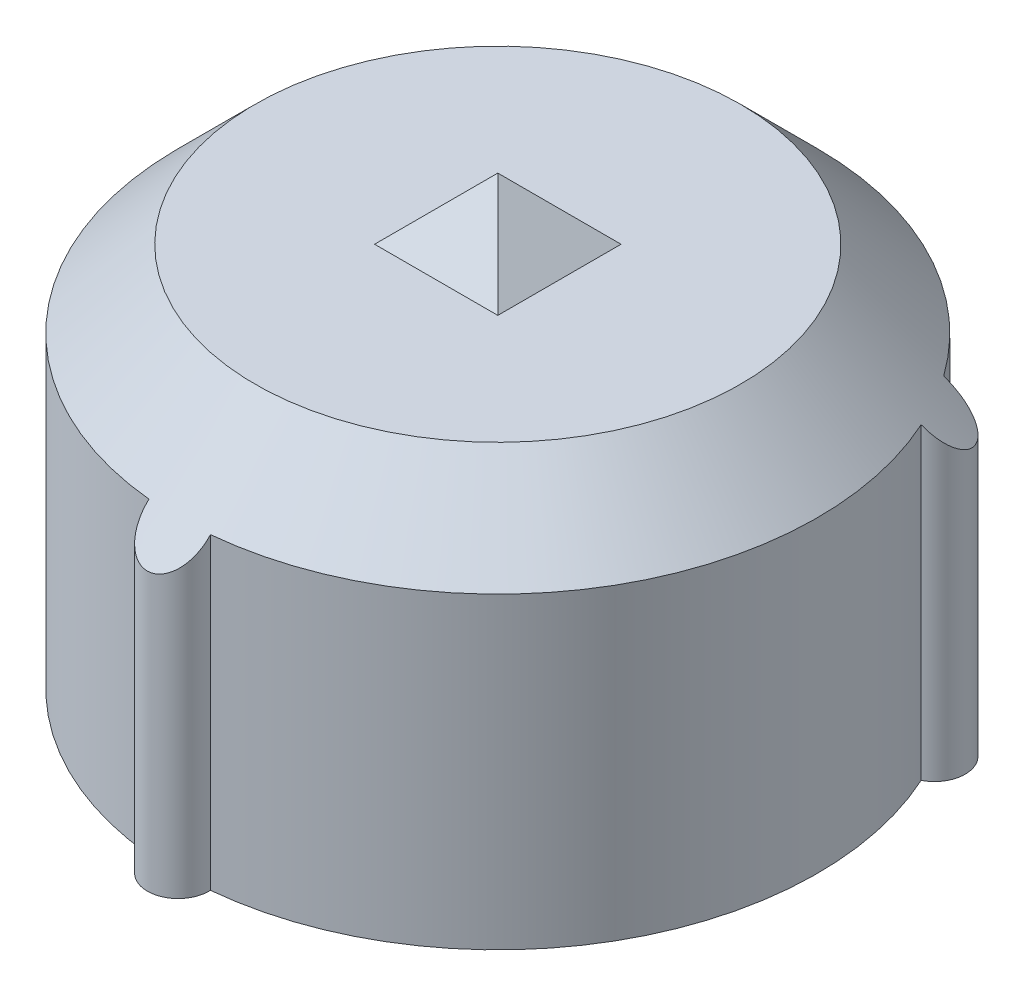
ISO-10303-21;
HEADER;
FILE_DESCRIPTION(('STEP AP214'),'2;1');
FILE_NAME('part.step','',(''),(''),'','','');
FILE_SCHEMA(('AUTOMOTIVE_DESIGN { 1 0 10303 214 1 1 1 1 }'));
ENDSEC;
DATA;
#1=APPLICATION_CONTEXT('core data for automotive mechanical design processes');
#2=APPLICATION_PROTOCOL_DEFINITION('international standard','automotive_design',2000,#1);
#3=PRODUCT_CONTEXT('',#1,'mechanical');
#4=PRODUCT('Part','Part','',(#3));
#5=PRODUCT_RELATED_PRODUCT_CATEGORY('part','',(#4));
#6=PRODUCT_DEFINITION_FORMATION('','',#4);
#7=PRODUCT_DEFINITION_CONTEXT('part definition',#1,'design');
#8=PRODUCT_DEFINITION('design','',#6,#7);
#9=PRODUCT_DEFINITION_SHAPE('','',#8);
#10=(LENGTH_UNIT() NAMED_UNIT(*) SI_UNIT(.MILLI.,.METRE.));
#11=(NAMED_UNIT(*) PLANE_ANGLE_UNIT() SI_UNIT($,.RADIAN.));
#12=(NAMED_UNIT(*) SI_UNIT($,.STERADIAN.) SOLID_ANGLE_UNIT());
#13=UNCERTAINTY_MEASURE_WITH_UNIT(LENGTH_MEASURE(1.E-05),#10,'distance_accuracy_value','');
#14=(GEOMETRIC_REPRESENTATION_CONTEXT(3) GLOBAL_UNCERTAINTY_ASSIGNED_CONTEXT((#13)) GLOBAL_UNIT_ASSIGNED_CONTEXT((#10,
#11,#12)) REPRESENTATION_CONTEXT('',''));
#15=CARTESIAN_POINT('',(0.,0.,0.));
#16=DIRECTION('',(0.,0.,1.));
#17=DIRECTION('',(1.,0.,0.));
#18=AXIS2_PLACEMENT_3D('',#15,#16,#17);
#19=CARTESIAN_POINT('',(4.55,5.,0.));
#20=DIRECTION('',(0.,-1.,0.));
#21=DIRECTION('',(0.,0.,-1.));
#22=AXIS2_PLACEMENT_3D('',#19,#20,#21);
#23=PLANE('',#22);
#24=DIRECTION('',(0.,0.,-1.));
#25=VECTOR('',#24,1.);
#26=CARTESIAN_POINT('',(0.8,5.,0.));
#27=LINE('',#26,#25);
#28=CARTESIAN_POINT('',(0.8,5.,0.799999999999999));
#29=VERTEX_POINT('',#28);
#30=CARTESIAN_POINT('',(0.8,5.,-0.800000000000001));
#31=VERTEX_POINT('',#30);
#32=EDGE_CURVE('E111',#29,#31,#27,.T.);
#33=ORIENTED_EDGE('',*,*,#32,.F.);
#34=DIRECTION('',(1.,0.,0.));
#35=VECTOR('',#34,1.);
#36=CARTESIAN_POINT('',(4.55,5.,0.799999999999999));
#37=LINE('',#36,#35);
#38=CARTESIAN_POINT('',(-0.799999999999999,5.,0.799999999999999));
#39=VERTEX_POINT('',#38);
#40=EDGE_CURVE('E107',#39,#29,#37,.T.);
#41=ORIENTED_EDGE('',*,*,#40,.F.);
#42=DIRECTION('',(0.,0.,1.));
#43=VECTOR('',#42,1.);
#44=CARTESIAN_POINT('',(-0.8,5.,0.));
#45=LINE('',#44,#43);
#46=CARTESIAN_POINT('',(-0.800000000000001,5.,-0.800000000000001));
#47=VERTEX_POINT('',#46);
#48=EDGE_CURVE('E110',#47,#39,#45,.T.);
#49=ORIENTED_EDGE('',*,*,#48,.F.);
#50=DIRECTION('',(-1.,0.,0.));
#51=VECTOR('',#50,1.);
#52=CARTESIAN_POINT('',(4.55,5.,-0.800000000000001));
#53=LINE('',#52,#51);
#54=EDGE_CURVE('E61',#31,#47,#53,.T.);
#55=ORIENTED_EDGE('',*,*,#54,.F.);
#56=EDGE_LOOP('',(#33,#41,#49,#55));
#57=FACE_BOUND('',#56,.T.);
#58=CARTESIAN_POINT('',(0.,5.,0.));
#59=DIRECTION('',(0.,-1.,0.));
#60=DIRECTION('',(0.,0.,-1.));
#61=AXIS2_PLACEMENT_3D('',#58,#59,#60);
#62=CIRCLE('',#61,3.15);
#63=CARTESIAN_POINT('',(0.,5.,-3.15));
#64=VERTEX_POINT('',#63);
#65=EDGE_CURVE('E249',#64,#64,#62,.T.);
#66=ORIENTED_EDGE('',*,*,#65,.F.);
#67=EDGE_LOOP('',(#66));
#68=FACE_BOUND('',#67,.T.);
#69=ADVANCED_FACE('F37',(#57,#68),#23,.F.);
#70=CARTESIAN_POINT('',(0.8,5.,0.));
#71=DIRECTION('',(0.707106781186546,0.707106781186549,0.));
#72=DIRECTION('',(-0.707106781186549,0.707106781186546,0.));
#73=AXIS2_PLACEMENT_3D('',#70,#71,#72);
#74=PLANE('',#73);
#75=DIRECTION('',(0.577350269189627,-0.577350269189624,0.577350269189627));
#76=VECTOR('',#75,1.);
#77=CARTESIAN_POINT('',(0.533333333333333,5.26666666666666,0.533333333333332));
#78=LINE('',#77,#76);
#79=CARTESIAN_POINT('',(0.,5.8,0.));
#80=VERTEX_POINT('',#79);
#81=EDGE_CURVE('E74',#80,#29,#78,.T.);
#82=ORIENTED_EDGE('',*,*,#81,.T.);
#83=ORIENTED_EDGE('',*,*,#32,.T.);
#84=DIRECTION('',(0.577350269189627,-0.577350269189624,-0.577350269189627));
#85=VECTOR('',#84,1.);
#86=CARTESIAN_POINT('',(2.05,3.75,-2.05));
#87=LINE('',#86,#85);
#88=EDGE_CURVE('E113',#80,#31,#87,.T.);
#89=ORIENTED_EDGE('',*,*,#88,.F.);
#90=EDGE_LOOP('',(#82,#83,#89));
#91=FACE_BOUND('',#90,.T.);
#92=ADVANCED_FACE('F140',(#91),#74,.T.);
#93=CARTESIAN_POINT('',(4.55,5.,-0.800000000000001));
#94=DIRECTION('',(0.,0.707106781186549,-0.707106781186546));
#95=DIRECTION('',(0.,0.707106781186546,0.707106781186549));
#96=AXIS2_PLACEMENT_3D('',#93,#94,#95);
#97=PLANE('',#96);
#98=ORIENTED_EDGE('',*,*,#88,.T.);
#99=ORIENTED_EDGE('',*,*,#54,.T.);
#100=DIRECTION('',(-0.577350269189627,-0.577350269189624,-0.577350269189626));
#101=VECTOR('',#100,1.);
#102=CARTESIAN_POINT('',(-0.533333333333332,5.26666666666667,-0.533333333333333));
#103=LINE('',#102,#101);
#104=EDGE_CURVE('E121',#80,#47,#103,.T.);
#105=ORIENTED_EDGE('',*,*,#104,.F.);
#106=EDGE_LOOP('',(#98,#99,#105));
#107=FACE_BOUND('',#106,.T.);
#108=ADVANCED_FACE('F138',(#107),#97,.T.);
#109=CARTESIAN_POINT('',(-0.8,5.,0.));
#110=DIRECTION('',(-0.707106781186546,0.707106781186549,0.));
#111=DIRECTION('',(-0.707106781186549,-0.707106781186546,0.));
#112=AXIS2_PLACEMENT_3D('',#109,#110,#111);
#113=PLANE('',#112);
#114=ORIENTED_EDGE('',*,*,#104,.T.);
#115=ORIENTED_EDGE('',*,*,#48,.T.);
#116=DIRECTION('',(-0.577350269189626,-0.577350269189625,0.577350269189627));
#117=VECTOR('',#116,1.);
#118=CARTESIAN_POINT('',(0.983333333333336,6.78333333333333,-0.983333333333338));
#119=LINE('',#118,#117);
#120=EDGE_CURVE('E119',#80,#39,#119,.T.);
#121=ORIENTED_EDGE('',*,*,#120,.F.);
#122=EDGE_LOOP('',(#114,#115,#121));
#123=FACE_BOUND('',#122,.T.);
#124=ADVANCED_FACE('F118',(#123),#113,.T.);
#125=CARTESIAN_POINT('',(4.55,5.,0.799999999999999));
#126=DIRECTION('',(0.,0.707106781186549,0.707106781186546));
#127=DIRECTION('',(0.,-0.707106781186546,0.707106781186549));
#128=AXIS2_PLACEMENT_3D('',#125,#126,#127);
#129=PLANE('',#128);
#130=ORIENTED_EDGE('',*,*,#120,.T.);
#131=ORIENTED_EDGE('',*,*,#40,.T.);
#132=ORIENTED_EDGE('',*,*,#81,.F.);
#133=EDGE_LOOP('',(#130,#131,#132));
#134=FACE_BOUND('',#133,.T.);
#135=ADVANCED_FACE('F39',(#134),#129,.T.);
#136=CARTESIAN_POINT('',(0.,1.,0.));
#137=DIRECTION('',(0.,-1.,0.));
#138=DIRECTION('',(0.,0.,-1.));
#139=AXIS2_PLACEMENT_3D('',#136,#137,#138);
#140=CONICAL_SURFACE('',#139,7.15000000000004,0.785398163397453);
#141=ORIENTED_EDGE('',*,*,#65,.T.);
#142=EDGE_LOOP('',(#141));
#143=FACE_BOUND('',#142,.T.);
#144=CARTESIAN_POINT('',(-0.399525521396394,4.00020000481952,4.13052289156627));
#145=CARTESIAN_POINT('',(-0.400256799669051,3.98508506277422,4.14563690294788));
#146=CARTESIAN_POINT('',(-0.400141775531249,3.97000027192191,4.16080392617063));
#147=CARTESIAN_POINT('',(-0.398167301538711,3.93994728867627,4.1911828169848));
#148=CARTESIAN_POINT('',(-0.396305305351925,3.92497929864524,4.20639471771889));
#149=CARTESIAN_POINT('',(-0.387975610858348,3.88015570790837,4.25219017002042));
#150=CARTESIAN_POINT('',(-0.378750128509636,3.85063355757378,4.28268027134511));
#151=CARTESIAN_POINT('',(-0.356224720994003,3.80200402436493,4.33339265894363));
#152=CARTESIAN_POINT('',(-0.344905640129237,3.78237596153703,4.35400984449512));
#153=CARTESIAN_POINT('',(-0.318010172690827,3.7447220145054,4.39381003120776));
#154=CARTESIAN_POINT('',(-0.302448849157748,3.72669075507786,4.41299780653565));
#155=CARTESIAN_POINT('',(-0.271063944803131,3.69698225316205,4.44478324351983));
#156=CARTESIAN_POINT('',(-0.256190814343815,3.68481603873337,4.45786028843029));
#157=CARTESIAN_POINT('',(-0.223779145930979,3.66228644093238,4.48216224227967));
#158=CARTESIAN_POINT('',(-0.206243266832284,3.65192128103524,4.49338897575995));
#159=CARTESIAN_POINT('',(-0.172248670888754,3.63531633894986,4.51142324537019));
#160=CARTESIAN_POINT('',(-0.156222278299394,3.62866679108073,4.51866524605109));
#161=CARTESIAN_POINT('',(-0.122759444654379,3.61725464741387,4.53111418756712));
#162=CARTESIAN_POINT('',(-0.105323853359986,3.6124909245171,4.53632234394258));
#163=CARTESIAN_POINT('',(-0.0693422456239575,3.60512985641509,4.54437719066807));
#164=CARTESIAN_POINT('',(-0.050789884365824,3.60254645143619,4.5472086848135));
#165=CARTESIAN_POINT('',(-0.0132949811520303,3.59979875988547,4.55022039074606));
#166=CARTESIAN_POINT('',(0.00564737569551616,3.59963335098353,4.55040183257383));
#167=CARTESIAN_POINT('',(0.0412428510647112,3.60161903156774,4.54822516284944));
#168=CARTESIAN_POINT('',(0.0579271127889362,3.60352819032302,4.54613227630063));
#169=CARTESIAN_POINT('',(0.0906003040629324,3.60916657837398,4.53995907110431));
#170=CARTESIAN_POINT('',(0.106589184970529,3.61289593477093,4.53587861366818));
#171=CARTESIAN_POINT('',(0.137922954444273,3.62208804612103,4.52583918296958));
#172=CARTESIAN_POINT('',(0.153240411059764,3.62759322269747,4.51983426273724));
#173=CARTESIAN_POINT('',(0.182543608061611,3.64004392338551,4.50628493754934));
#174=CARTESIAN_POINT('',(0.196528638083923,3.64699020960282,4.49873971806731));
#175=CARTESIAN_POINT('',(0.229168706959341,3.66555239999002,4.4786325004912));
#176=CARTESIAN_POINT('',(0.247004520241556,3.67784476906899,4.46536128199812));
#177=CARTESIAN_POINT('',(0.279520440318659,3.7042930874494,4.43694385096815));
#178=CARTESIAN_POINT('',(0.294194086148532,3.71845275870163,4.42179389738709));
#179=CARTESIAN_POINT('',(0.3250530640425,3.75326284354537,4.38474706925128));
#180=CARTESIAN_POINT('',(0.339996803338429,3.77446085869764,4.36233290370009));
#181=CARTESIAN_POINT('',(0.364772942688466,3.81842025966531,4.31621644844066));
#182=CARTESIAN_POINT('',(0.374593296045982,3.84118518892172,4.29251126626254));
#183=CARTESIAN_POINT('',(0.389130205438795,3.8865502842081,4.24566450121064));
#184=CARTESIAN_POINT('',(0.394063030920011,3.90910880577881,4.2225480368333));
#185=CARTESIAN_POINT('',(0.399793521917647,3.95450369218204,4.17640583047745));
#186=CARTESIAN_POINT('',(0.400621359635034,3.9773367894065,4.15338067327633));
#187=CARTESIAN_POINT('',(0.399525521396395,4.00020000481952,4.13052289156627));
#188=B_SPLINE_CURVE_WITH_KNOTS('',3,(#144,#145,#146,#147,#148,#149,#150,#151,#152,#153,#154,
#155,#156,#157,#158,#159,#160,#161,#162,#163,#164,#165,#166,#167,#168,#169,#170,#171,#172,#173,
#174,#175,#176,#177,#178,#179,#180,#181,#182,#183,#184,#185,#186,#187),.UNSPECIFIED.,.F.,.F.,(4,
2,2,2,2,2,2,2,2,2,2,2,2,2,2,2,2,2,2,2,2,4),(0.,0.0641179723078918,0.12832954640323,
0.257815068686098,0.349429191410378,0.440722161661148,0.510209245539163,0.579627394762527,
0.635807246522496,0.691953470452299,0.748456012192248,0.804932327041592,0.855465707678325,
0.906002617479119,0.957849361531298,1.00972359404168,1.08551176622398,1.16145335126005,
1.26374061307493,1.36626731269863,1.46402219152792,1.56105748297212),.UNSPECIFIED.);
#189=CARTESIAN_POINT('',(-0.399535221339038,4.00000000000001,4.13072289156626));
#190=VERTEX_POINT('',#189);
#191=CARTESIAN_POINT('',(0.399535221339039,4.00000000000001,4.13072289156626));
#192=VERTEX_POINT('',#191);
#193=EDGE_CURVE('E131',#190,#192,#188,.T.);
#194=ORIENTED_EDGE('',*,*,#193,.T.);
#195=CARTESIAN_POINT('',(0.,4.00000000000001,0.));
#196=DIRECTION('',(0.,-1.,0.));
#197=DIRECTION('',(0.,0.,-1.));
#198=AXIS2_PLACEMENT_3D('',#195,#196,#197);
#199=CIRCLE('',#198,4.15);
#200=CARTESIAN_POINT('',(3.77707857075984,4.00000000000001,-1.71935379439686));
#201=VERTEX_POINT('',#200);
#202=EDGE_CURVE('E213',#192,#201,#199,.F.);
#203=ORIENTED_EDGE('',*,*,#202,.T.);
#204=CARTESIAN_POINT('',(3.31649011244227,4.38274373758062,-1.7869283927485));
#205=CARTESIAN_POINT('',(3.33206933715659,4.37614462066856,-1.77192294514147));
#206=CARTESIAN_POINT('',(3.34838268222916,4.36791848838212,-1.75863519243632));
#207=CARTESIAN_POINT('',(3.38167759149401,4.34907165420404,-1.73540647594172));
#208=CARTESIAN_POINT('',(3.39864953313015,4.33847903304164,-1.72542942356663));
#209=CARTESIAN_POINT('',(3.43303008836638,4.31544889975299,-1.7083107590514));
#210=CARTESIAN_POINT('',(3.45044145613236,4.30299226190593,-1.70120175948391));
#211=CARTESIAN_POINT('',(3.48526311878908,4.27679303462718,-1.68962662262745));
#212=CARTESIAN_POINT('',(3.50267314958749,4.26304566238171,-1.68517080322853));
#213=CARTESIAN_POINT('',(3.54584300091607,4.22760207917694,-1.67703556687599));
#214=CARTESIAN_POINT('',(3.57143702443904,4.20536073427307,-1.67485147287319));
#215=CARTESIAN_POINT('',(3.62154733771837,4.15980293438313,-1.6751639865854));
#216=CARTESIAN_POINT('',(3.64606393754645,4.13648679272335,-1.67765923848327));
#217=CARTESIAN_POINT('',(3.68863471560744,4.09435934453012,-1.68588678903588));
#218=CARTESIAN_POINT('',(3.70695087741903,4.07564935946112,-1.6908140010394));
#219=CARTESIAN_POINT('',(3.74259832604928,4.03809738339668,-1.70314519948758));
#220=CARTESIAN_POINT('',(3.75992915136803,4.01925533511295,-1.71055033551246));
#221=CARTESIAN_POINT('',(3.80374596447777,3.97005822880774,-1.73304245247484));
#222=CARTESIAN_POINT('',(3.82931579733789,3.93974117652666,-1.75005393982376));
#223=CARTESIAN_POINT('',(3.87656266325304,3.88005670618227,-1.79018123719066));
#224=CARTESIAN_POINT('',(3.89823923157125,3.85068940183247,-1.81329777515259));
#225=CARTESIAN_POINT('',(3.93081435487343,3.80220050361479,-1.85800384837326));
#226=CARTESIAN_POINT('',(3.94301646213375,3.78257392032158,-1.87809828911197));
#227=CARTESIAN_POINT('',(3.9640710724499,3.74489035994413,-1.92128977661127));
#228=CARTESIAN_POINT('',(3.97292956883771,3.72683061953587,-1.94438135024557));
#229=CARTESIAN_POINT('',(3.98479151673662,3.69708568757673,-1.98748311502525));
#230=CARTESIAN_POINT('',(3.98868913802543,3.68490971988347,-2.00690669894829));
#231=CARTESIAN_POINT('',(3.99354562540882,3.66236389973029,-2.04713299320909));
#232=CARTESIAN_POINT('',(3.99450813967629,3.65199182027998,-2.067933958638));
#233=CARTESIAN_POINT('',(3.99314295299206,3.63537375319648,-2.10639507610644));
#234=CARTESIAN_POINT('',(3.99140767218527,3.62871811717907,-2.12389775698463));
#235=CARTESIAN_POINT('',(3.98546905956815,3.61729360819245,-2.15910834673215));
#236=CARTESIAN_POINT('',(3.9812671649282,3.61252363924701,-2.17681613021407));
#237=CARTESIAN_POINT('',(3.97026201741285,3.60515038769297,-2.21201386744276));
#238=CARTESIAN_POINT('',(3.96344243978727,3.60256103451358,-2.22950172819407));
#239=CARTESIAN_POINT('',(3.94731044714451,3.59980223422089,-2.26349091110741));
#240=CARTESIAN_POINT('',(3.93799916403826,3.59963169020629,-2.27999267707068));
#241=CARTESIAN_POINT('',(3.91832132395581,3.60160870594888,-2.30974134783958));
#242=CARTESIAN_POINT('',(3.90816933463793,3.60351390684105,-2.32314800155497));
#243=CARTESIAN_POINT('',(3.88649097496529,3.60914497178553,-2.34836559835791));
#244=CARTESIAN_POINT('',(3.87496452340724,3.61287094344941,-2.36017644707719));
#245=CARTESIAN_POINT('',(3.8506079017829,3.62205613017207,-2.38229949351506));
#246=CARTESIAN_POINT('',(3.83775180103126,3.62755751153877,-2.39256526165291));
#247=CARTESIAN_POINT('',(3.81137174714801,3.64000082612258,-2.41117404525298));
#248=CARTESIAN_POINT('',(3.79784745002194,3.64694350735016,-2.419516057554));
#249=CARTESIAN_POINT('',(3.76412436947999,3.66549460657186,-2.43773528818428));
#250=CARTESIAN_POINT('',(3.74372087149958,3.6777790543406,-2.44654948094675));
#251=CARTESIAN_POINT('',(3.70286324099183,3.70421371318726,-2.46051054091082));
#252=CARTESIAN_POINT('',(3.68240909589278,3.71836797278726,-2.46564929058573));
#253=CARTESIAN_POINT('',(3.6348868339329,3.7531770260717,-2.47386722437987));
#254=CARTESIAN_POINT('',(3.60799159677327,3.77438098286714,-2.47560923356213));
#255=CARTESIAN_POINT('',(3.55567564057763,3.81832547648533,-2.47402030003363));
#256=CARTESIAN_POINT('',(3.53025648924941,3.84106759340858,-2.47068406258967));
#257=CARTESIAN_POINT('',(3.48247444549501,3.88636889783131,-2.45987881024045));
#258=CARTESIAN_POINT('',(3.46002381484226,3.9088857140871,-2.45261306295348));
#259=CARTESIAN_POINT('',(3.41712390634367,3.95433625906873,-2.43451929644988));
#260=CARTESIAN_POINT('',(3.39667234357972,3.97726947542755,-2.42369540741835));
#261=CARTESIAN_POINT('',(3.3677335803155,4.01165664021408,-2.4050480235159));
#262=CARTESIAN_POINT('',(3.35840128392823,4.02308430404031,-2.3984525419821));
#263=CARTESIAN_POINT('',(3.34033125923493,4.04590815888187,-2.38448247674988));
#264=CARTESIAN_POINT('',(3.33159288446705,4.05730437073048,-2.37710876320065));
#265=CARTESIAN_POINT('',(3.3231609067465,4.06867319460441,-2.36935224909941));
#266=B_SPLINE_CURVE_WITH_KNOTS('',3,(#204,#205,#206,#207,#208,#209,#210,#211,#212,#213,#214,
#215,#216,#217,#218,#219,#220,#221,#222,#223,#224,#225,#226,#227,#228,#229,#230,#231,#232,#233,
#234,#235,#236,#237,#238,#239,#240,#241,#242,#243,#244,#245,#246,#247,#248,#249,#250,#251,#252,
#253,#254,#255,#256,#257,#258,#259,#260,#261,#262,#263,#264,#265),.UNSPECIFIED.,.F.,.F.,(4,2,2,
2,2,2,2,2,2,2,2,2,2,2,2,2,2,2,2,2,2,2,2,2,2,2,2,2,2,2,4),(0.,0.0674817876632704,
0.134201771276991,0.201660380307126,0.269379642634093,0.370869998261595,0.472330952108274,
0.552124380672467,0.631954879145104,0.760826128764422,0.889712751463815,0.981289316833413,
1.07270094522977,1.1422188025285,1.21165021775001,1.26784155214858,1.32400017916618,
1.38051487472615,1.43700394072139,1.48754090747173,1.53808086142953,1.5899224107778,
1.64179093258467,1.71755316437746,1.79348221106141,1.89580927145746,1.99824309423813,
2.09582435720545,2.19329274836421,2.24175097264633,2.29015557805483),.UNSPECIFIED.);
#267=CARTESIAN_POINT('',(3.3775433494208,4.00000000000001,-2.41136909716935));
#268=VERTEX_POINT('',#267);
#269=EDGE_CURVE('E52',#201,#268,#266,.T.);
#270=ORIENTED_EDGE('',*,*,#269,.T.);
#271=CARTESIAN_POINT('',(0.,4.00000000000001,0.));
#272=DIRECTION('',(0.,-1.,0.));
#273=DIRECTION('',(0.,0.,-1.));
#274=AXIS2_PLACEMENT_3D('',#271,#272,#273);
#275=CIRCLE('',#274,4.15);
#276=CARTESIAN_POINT('',(-3.37754334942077,4.00000000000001,-2.41136909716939));
#277=VERTEX_POINT('',#276);
#278=EDGE_CURVE('E11',#268,#277,#275,.F.);
#279=ORIENTED_EDGE('',*,*,#278,.T.);
#280=CARTESIAN_POINT('',(-3.32316090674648,4.06867319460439,-2.36935224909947));
#281=CARTESIAN_POINT('',(-3.33474926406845,4.05305120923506,-2.38000692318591));
#282=CARTESIAN_POINT('',(-3.34690916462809,4.03738283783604,-2.38994094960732));
#283=CARTESIAN_POINT('',(-3.37231555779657,4.00602772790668,-2.40831792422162));
#284=CARTESIAN_POINT('',(-3.3855629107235,3.99034098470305,-2.41675967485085));
#285=CARTESIAN_POINT('',(-3.42701130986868,3.94318732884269,-2.43985328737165));
#286=CARTESIAN_POINT('',(-3.4567573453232,3.91184457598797,-2.45212501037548));
#287=CARTESIAN_POINT('',(-3.51262168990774,3.85735862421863,-2.4674540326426));
#288=CARTESIAN_POINT('',(-3.538084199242,3.83393693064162,-2.47195022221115));
#289=CARTESIAN_POINT('',(-3.59060683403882,3.78856700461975,-2.47584747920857));
#290=CARTESIAN_POINT('',(-3.61766176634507,3.76661443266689,-2.47526428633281));
#291=CARTESIAN_POINT('',(-3.66545806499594,3.73051626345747,-2.46909598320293));
#292=CARTESIAN_POINT('',(-3.68597574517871,3.71584193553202,-2.46487524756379));
#293=CARTESIAN_POINT('',(-3.7271256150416,3.68822308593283,-2.45280584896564));
#294=CARTESIAN_POINT('',(-3.74775763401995,3.67527647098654,-2.44496162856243));
#295=CARTESIAN_POINT('',(-3.78416294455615,3.6542535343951,-2.42736034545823));
#296=CARTESIAN_POINT('',(-3.80003976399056,3.64572646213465,-2.41836032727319));
#297=CARTESIAN_POINT('',(-3.83100133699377,3.63053481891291,-2.39776593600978));
#298=CARTESIAN_POINT('',(-3.84608645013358,3.62386939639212,-2.38617275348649));
#299=CARTESIAN_POINT('',(-3.87501393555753,3.61276037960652,-2.36033002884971));
#300=CARTESIAN_POINT('',(-3.8888441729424,3.60833690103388,-2.34605795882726));
#301=CARTESIAN_POINT('',(-3.91443504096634,3.60216143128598,-2.31525881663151));
#302=CARTESIAN_POINT('',(-3.92619777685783,3.60040670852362,-2.29873406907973));
#303=CARTESIAN_POINT('',(-3.945594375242,3.59976821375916,-2.26653840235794));
#304=CARTESIAN_POINT('',(-3.95357814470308,3.60050973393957,-2.25108337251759));
#305=CARTESIAN_POINT('',(-3.96740520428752,3.60400892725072,-2.21946509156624));
#306=CARTESIAN_POINT('',(-3.97324865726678,3.60676644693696,-2.20330189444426));
#307=CARTESIAN_POINT('',(-3.98262084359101,3.61402799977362,-2.17118254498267));
#308=CARTESIAN_POINT('',(-3.98620515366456,3.61848537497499,-2.15523173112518));
#309=CARTESIAN_POINT('',(-3.99137846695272,3.62891915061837,-2.12351158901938));
#310=CARTESIAN_POINT('',(-3.99296664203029,3.6348961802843,-2.10774233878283));
#311=CARTESIAN_POINT('',(-3.99456852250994,3.65075218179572,-2.07051670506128));
#312=CARTESIAN_POINT('',(-3.99370988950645,3.66123908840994,-2.0492806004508));
#313=CARTESIAN_POINT('',(-3.98893489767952,3.6841031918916,-2.00821580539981));
#314=CARTESIAN_POINT('',(-3.9850125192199,3.69648407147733,-1.98838996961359));
#315=CARTESIAN_POINT('',(-3.97284216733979,3.72711185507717,-1.94392793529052));
#316=CARTESIAN_POINT('',(-3.96357498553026,3.745918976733,-1.91995824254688));
#317=CARTESIAN_POINT('',(-3.94146796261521,3.78519054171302,-1.87526721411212));
#318=CARTESIAN_POINT('',(-3.92862300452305,3.80565732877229,-1.85455059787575));
#319=CARTESIAN_POINT('',(-3.89575759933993,3.85407696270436,-1.81059234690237));
#320=CARTESIAN_POINT('',(-3.87474368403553,3.88240797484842,-1.78851009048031));
#321=CARTESIAN_POINT('',(-3.8290938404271,3.93996563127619,-1.74999759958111));
#322=CARTESIAN_POINT('',(-3.80445449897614,3.96919309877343,-1.73357274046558));
#323=CARTESIAN_POINT('',(-3.75202989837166,4.02819048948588,-1.70633755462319));
#324=CARTESIAN_POINT('',(-3.7242083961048,4.05796256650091,-1.69560181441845));
#325=CARTESIAN_POINT('',(-3.66629416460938,4.11693754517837,-1.68044915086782));
#326=CARTESIAN_POINT('',(-3.63620204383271,4.14614059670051,-1.67603054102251));
#327=CARTESIAN_POINT('',(-3.58193800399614,4.19599559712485,-1.67450097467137));
#328=CARTESIAN_POINT('',(-3.55812186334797,4.21698968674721,-1.67586490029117));
#329=CARTESIAN_POINT('',(-3.50992088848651,4.25738440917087,-1.68318145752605));
#330=CARTESIAN_POINT('',(-3.48553847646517,4.27679063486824,-1.68911714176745));
#331=CARTESIAN_POINT('',(-3.44448741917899,4.30727806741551,-1.70357699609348));
#332=CARTESIAN_POINT('',(-3.42783162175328,4.31904410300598,-1.71067764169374));
#333=CARTESIAN_POINT('',(-3.39989862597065,4.33753492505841,-1.72501805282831));
#334=CARTESIAN_POINT('',(-3.38854556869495,4.34469592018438,-1.73154071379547));
#335=CARTESIAN_POINT('',(-3.35635116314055,4.3638224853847,-1.75228755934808));
#336=CARTESIAN_POINT('',(-3.33588866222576,4.37451767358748,-1.76826062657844));
#337=CARTESIAN_POINT('',(-3.31649011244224,4.38274373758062,-1.78692839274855));
#338=B_SPLINE_CURVE_WITH_KNOTS('',3,(#280,#281,#282,#283,#284,#285,#286,#287,#288,#289,#290,
#291,#292,#293,#294,#295,#296,#297,#298,#299,#300,#301,#302,#303,#304,#305,#306,#307,#308,#309,
#310,#311,#312,#313,#314,#315,#316,#317,#318,#319,#320,#321,#322,#323,#324,#325,#326,#327,#328,
#329,#330,#331,#332,#333,#334,#335,#336,#337),.UNSPECIFIED.,.F.,.F.,(4,2,2,2,2,2,2,2,2,2,2,2,2,
2,2,2,2,2,2,2,2,2,2,2,2,2,2,2,4),(0.,0.0664845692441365,0.133022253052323,0.267013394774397,
0.371326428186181,0.475316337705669,0.55178981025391,0.628169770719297,0.688372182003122,
0.748547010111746,0.809252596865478,0.869896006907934,0.92186627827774,0.973832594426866,
1.02446471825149,1.07511784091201,1.14582597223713,1.21667338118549,1.31169171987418,
1.40684665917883,1.53104591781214,1.65536286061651,1.78127166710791,1.90714685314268,
2.00218335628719,2.09686924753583,2.16144285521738,2.20611835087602,2.28983714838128),.UNSPECIFIED.);
#339=CARTESIAN_POINT('',(-3.77707857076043,4.00000000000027,-1.71935379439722));
#340=VERTEX_POINT('',#339);
#341=EDGE_CURVE('E219',#277,#340,#338,.T.);
#342=ORIENTED_EDGE('',*,*,#341,.T.);
#343=CARTESIAN_POINT('',(0.,4.00000000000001,0.));
#344=DIRECTION('',(0.,-1.,0.));
#345=DIRECTION('',(0.,0.,-1.));
#346=AXIS2_PLACEMENT_3D('',#343,#344,#345);
#347=CIRCLE('',#346,4.15);
#348=EDGE_CURVE('E84',#340,#190,#347,.F.);
#349=ORIENTED_EDGE('',*,*,#348,.T.);
#350=EDGE_LOOP('',(#194,#203,#270,#279,#342,#349));
#351=FACE_BOUND('',#350,.T.);
#352=ADVANCED_FACE('F236',(#143,#351),#140,.T.);
#353=CARTESIAN_POINT('',(0.,0.,0.));
#354=DIRECTION('',(0.,1.,0.));
#355=DIRECTION('',(0.,0.,1.));
#356=AXIS2_PLACEMENT_3D('',#353,#354,#355);
#357=PLANE('',#356);
#358=CARTESIAN_POINT('',(0.,0.,0.));
#359=DIRECTION('',(0.,1.,0.));
#360=DIRECTION('',(0.,0.,1.));
#361=AXIS2_PLACEMENT_3D('',#358,#359,#360);
#362=CIRCLE('',#361,4.15);
#363=CARTESIAN_POINT('',(0.399535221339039,0.,4.13072289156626));
#364=VERTEX_POINT('',#363);
#365=CARTESIAN_POINT('',(3.77707857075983,0.,-1.71935379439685));
#366=VERTEX_POINT('',#365);
#367=EDGE_CURVE('E156',#364,#366,#362,.T.);
#368=ORIENTED_EDGE('',*,*,#367,.F.);
#369=CARTESIAN_POINT('',(0.,0.,4.15));
#370=DIRECTION('',(0.,1.,0.));
#371=DIRECTION('',(0.,0.,1.));
#372=AXIS2_PLACEMENT_3D('',#369,#370,#371);
#373=CIRCLE('',#372,0.4);
#374=CARTESIAN_POINT('',(-0.399535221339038,0.,4.13072289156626));
#375=VERTEX_POINT('',#374);
#376=EDGE_CURVE('E148',#375,#364,#373,.T.);
#377=ORIENTED_EDGE('',*,*,#376,.F.);
#378=CARTESIAN_POINT('',(0.,0.,0.));
#379=DIRECTION('',(0.,1.,0.));
#380=DIRECTION('',(0.,0.,1.));
#381=AXIS2_PLACEMENT_3D('',#378,#379,#380);
#382=CIRCLE('',#381,4.15);
#383=CARTESIAN_POINT('',(-3.77707857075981,0.,-1.7193537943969));
#384=VERTEX_POINT('',#383);
#385=EDGE_CURVE('E142',#384,#375,#382,.T.);
#386=ORIENTED_EDGE('',*,*,#385,.F.);
#387=CARTESIAN_POINT('',(-3.59400542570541,0.,-2.07500000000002));
#388=DIRECTION('',(0.,1.,0.));
#389=DIRECTION('',(0.,0.,1.));
#390=AXIS2_PLACEMENT_3D('',#387,#388,#389);
#391=CIRCLE('',#390,0.4);
#392=CARTESIAN_POINT('',(-3.37754334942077,0.,-2.41136909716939));
#393=VERTEX_POINT('',#392);
#394=EDGE_CURVE('E167',#393,#384,#391,.T.);
#395=ORIENTED_EDGE('',*,*,#394,.F.);
#396=CARTESIAN_POINT('',(0.,0.,0.));
#397=DIRECTION('',(0.,1.,0.));
#398=DIRECTION('',(0.,0.,1.));
#399=AXIS2_PLACEMENT_3D('',#396,#397,#398);
#400=CIRCLE('',#399,4.15);
#401=CARTESIAN_POINT('',(3.3775433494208,0.,-2.41136909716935));
#402=VERTEX_POINT('',#401);
#403=EDGE_CURVE('E164',#402,#393,#400,.T.);
#404=ORIENTED_EDGE('',*,*,#403,.F.);
#405=CARTESIAN_POINT('',(3.59400542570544,0.,-2.07499999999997));
#406=DIRECTION('',(0.,1.,0.));
#407=DIRECTION('',(0.,0.,1.));
#408=AXIS2_PLACEMENT_3D('',#405,#406,#407);
#409=CIRCLE('',#408,0.4);
#410=EDGE_CURVE('E160',#366,#402,#409,.T.);
#411=ORIENTED_EDGE('',*,*,#410,.F.);
#412=EDGE_LOOP('',(#368,#377,#386,#395,#404,#411));
#413=FACE_BOUND('',#412,.T.);
#414=ADVANCED_FACE('F192',(#413),#357,.F.);
#415=CARTESIAN_POINT('',(0.,5.,0.));
#416=DIRECTION('',(0.,-1.,0.));
#417=DIRECTION('',(0.,0.,-1.));
#418=AXIS2_PLACEMENT_3D('',#415,#416,#417);
#419=CYLINDRICAL_SURFACE('',#418,4.15);
#420=ORIENTED_EDGE('',*,*,#348,.F.);
#421=DIRECTION('',(0.,-1.,0.));
#422=VECTOR('',#421,1.);
#423=CARTESIAN_POINT('',(-3.77707857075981,5.,-1.7193537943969));
#424=LINE('',#423,#422);
#425=EDGE_CURVE('E171',#340,#384,#424,.T.);
#426=ORIENTED_EDGE('',*,*,#425,.T.);
#427=ORIENTED_EDGE('',*,*,#385,.T.);
#428=DIRECTION('',(0.,-1.,0.));
#429=VECTOR('',#428,1.);
#430=CARTESIAN_POINT('',(-0.399535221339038,5.,4.13072289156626));
#431=LINE('',#430,#429);
#432=EDGE_CURVE('E46',#190,#375,#431,.T.);
#433=ORIENTED_EDGE('',*,*,#432,.F.);
#434=EDGE_LOOP('',(#420,#426,#427,#433));
#435=FACE_BOUND('',#434,.T.);
#436=ADVANCED_FACE('F195',(#435),#419,.T.);
#437=CARTESIAN_POINT('',(0.,5.,0.));
#438=DIRECTION('',(0.,-1.,0.));
#439=DIRECTION('',(0.,0.,-1.));
#440=AXIS2_PLACEMENT_3D('',#437,#438,#439);
#441=CYLINDRICAL_SURFACE('',#440,4.15);
#442=ORIENTED_EDGE('',*,*,#278,.F.);
#443=DIRECTION('',(0.,-1.,0.));
#444=VECTOR('',#443,1.);
#445=CARTESIAN_POINT('',(3.3775433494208,5.,-2.41136909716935));
#446=LINE('',#445,#444);
#447=EDGE_CURVE('E176',#268,#402,#446,.T.);
#448=ORIENTED_EDGE('',*,*,#447,.T.);
#449=ORIENTED_EDGE('',*,*,#403,.T.);
#450=DIRECTION('',(0.,-1.,0.));
#451=VECTOR('',#450,1.);
#452=CARTESIAN_POINT('',(-3.37754334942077,5.,-2.41136909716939));
#453=LINE('',#452,#451);
#454=EDGE_CURVE('E174',#277,#393,#453,.T.);
#455=ORIENTED_EDGE('',*,*,#454,.F.);
#456=EDGE_LOOP('',(#442,#448,#449,#455));
#457=FACE_BOUND('',#456,.T.);
#458=ADVANCED_FACE('F204',(#457),#441,.T.);
#459=CARTESIAN_POINT('',(-3.59400542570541,5.,-2.07500000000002));
#460=DIRECTION('',(0.,-1.,0.));
#461=DIRECTION('',(0.,0.,-1.));
#462=AXIS2_PLACEMENT_3D('',#459,#460,#461);
#463=CYLINDRICAL_SURFACE('',#462,0.4);
#464=ORIENTED_EDGE('',*,*,#341,.F.);
#465=ORIENTED_EDGE('',*,*,#454,.T.);
#466=ORIENTED_EDGE('',*,*,#394,.T.);
#467=ORIENTED_EDGE('',*,*,#425,.F.);
#468=EDGE_LOOP('',(#464,#465,#466,#467));
#469=FACE_BOUND('',#468,.T.);
#470=ADVANCED_FACE('F200',(#469),#463,.T.);
#471=CARTESIAN_POINT('',(0.,5.,0.));
#472=DIRECTION('',(0.,-1.,0.));
#473=DIRECTION('',(0.,0.,-1.));
#474=AXIS2_PLACEMENT_3D('',#471,#472,#473);
#475=CYLINDRICAL_SURFACE('',#474,4.15);
#476=ORIENTED_EDGE('',*,*,#202,.F.);
#477=DIRECTION('',(0.,-1.,0.));
#478=VECTOR('',#477,1.);
#479=CARTESIAN_POINT('',(0.399535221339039,5.,4.13072289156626));
#480=LINE('',#479,#478);
#481=EDGE_CURVE('E182',#192,#364,#480,.T.);
#482=ORIENTED_EDGE('',*,*,#481,.T.);
#483=ORIENTED_EDGE('',*,*,#367,.T.);
#484=DIRECTION('',(0.,-1.,0.));
#485=VECTOR('',#484,1.);
#486=CARTESIAN_POINT('',(3.77707857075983,5.,-1.71935379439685));
#487=LINE('',#486,#485);
#488=EDGE_CURVE('E179',#201,#366,#487,.T.);
#489=ORIENTED_EDGE('',*,*,#488,.F.);
#490=EDGE_LOOP('',(#476,#482,#483,#489));
#491=FACE_BOUND('',#490,.T.);
#492=ADVANCED_FACE('F212',(#491),#475,.T.);
#493=CARTESIAN_POINT('',(3.59400542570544,5.,-2.07499999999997));
#494=DIRECTION('',(0.,-1.,0.));
#495=DIRECTION('',(0.,0.,-1.));
#496=AXIS2_PLACEMENT_3D('',#493,#494,#495);
#497=CYLINDRICAL_SURFACE('',#496,0.4);
#498=ORIENTED_EDGE('',*,*,#269,.F.);
#499=ORIENTED_EDGE('',*,*,#488,.T.);
#500=ORIENTED_EDGE('',*,*,#410,.T.);
#501=ORIENTED_EDGE('',*,*,#447,.F.);
#502=EDGE_LOOP('',(#498,#499,#500,#501));
#503=FACE_BOUND('',#502,.T.);
#504=ADVANCED_FACE('F208',(#503),#497,.T.);
#505=CARTESIAN_POINT('',(0.,5.,4.15));
#506=DIRECTION('',(0.,-1.,0.));
#507=DIRECTION('',(0.,0.,-1.));
#508=AXIS2_PLACEMENT_3D('',#505,#506,#507);
#509=CYLINDRICAL_SURFACE('',#508,0.4);
#510=ORIENTED_EDGE('',*,*,#193,.F.);
#511=ORIENTED_EDGE('',*,*,#432,.T.);
#512=ORIENTED_EDGE('',*,*,#376,.T.);
#513=ORIENTED_EDGE('',*,*,#481,.F.);
#514=EDGE_LOOP('',(#510,#511,#512,#513));
#515=FACE_BOUND('',#514,.T.);
#516=ADVANCED_FACE('F186',(#515),#509,.T.);
#517=CLOSED_SHELL('',(#69,#92,#108,#124,#135,#352,#414,#436,#458,#470,#492,#504,#516));
#518=MANIFOLD_SOLID_BREP('B2',#517);
#519=ADVANCED_BREP_SHAPE_REPRESENTATION('',(#18,#518),#14);
#520=SHAPE_DEFINITION_REPRESENTATION(#9,#519);
ENDSEC;
END-ISO-10303-21;
